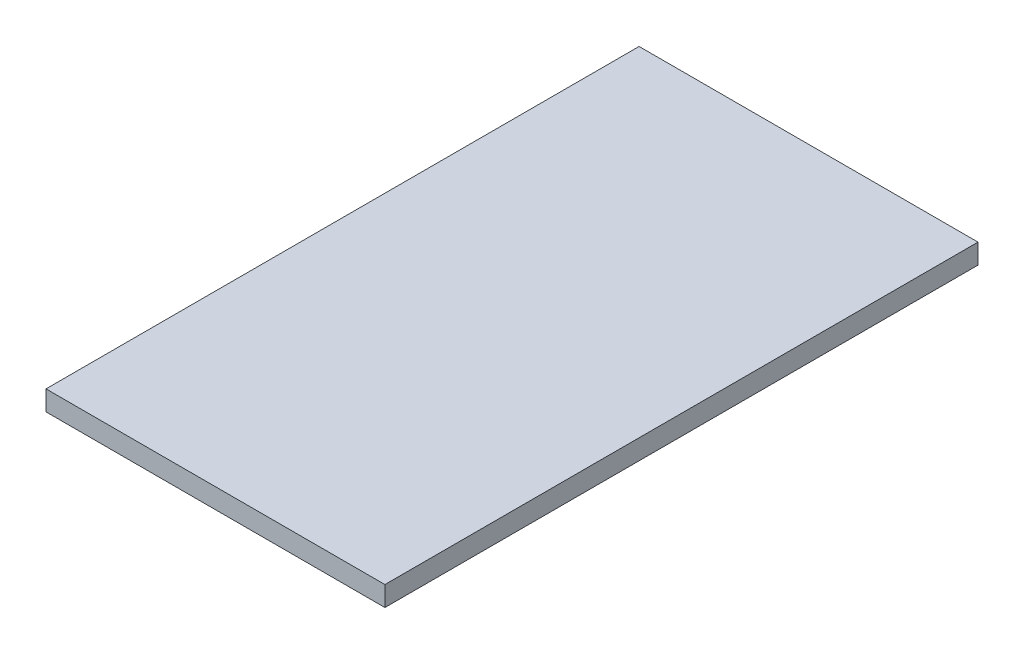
from build123d import *

# Parameters (mm, degrees)
ESQUISSE1_W        = 680
ESQUISSE1_H        = 1190
BOSS_EXTRU_1_DEPTH = 40


with BuildPart() as part:
    # Esquisse1 → Boss.-Extru.1 (new body)
    with BuildSketch(Plane(origin=(0, 0, 0), x_dir=(1, 0, 0), z_dir=(0, 1, 0))):
        Rectangle(ESQUISSE1_W, ESQUISSE1_H)
    extrude(amount=BOSS_EXTRU_1_DEPTH)


solid = part.part
